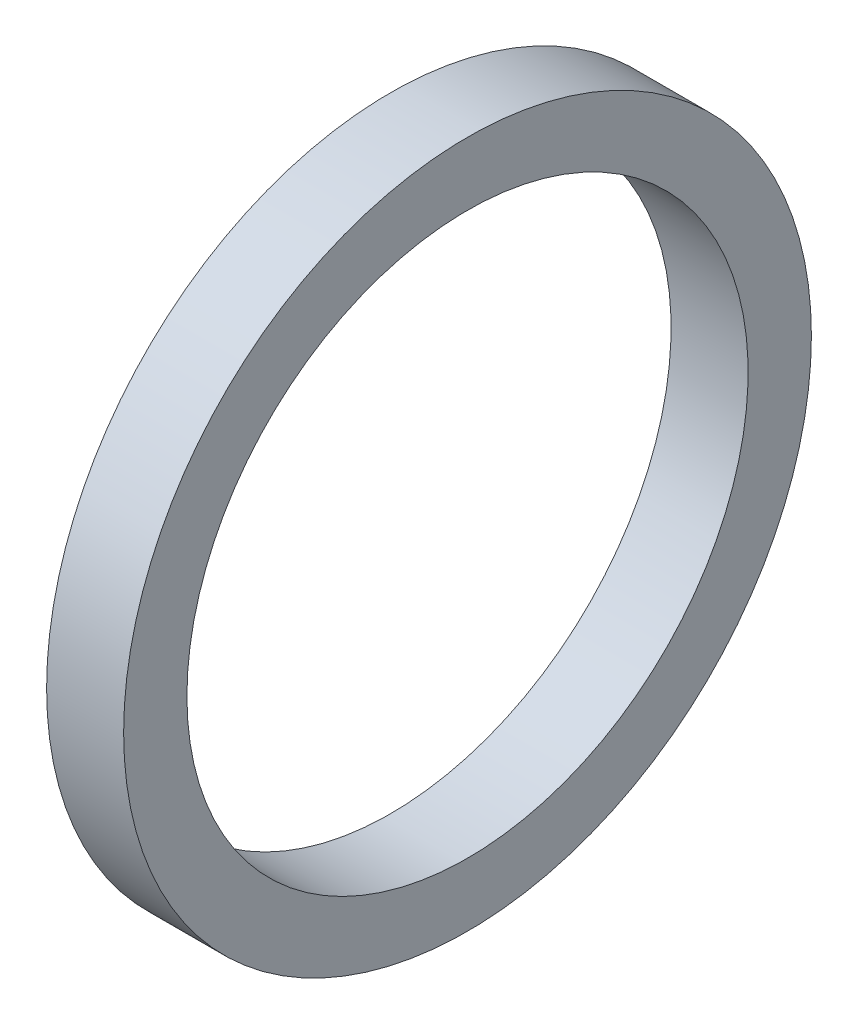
ISO-10303-21;
HEADER;
FILE_DESCRIPTION(('STEP AP214'),'2;1');
FILE_NAME('part.step','',(''),(''),'','','');
FILE_SCHEMA(('AUTOMOTIVE_DESIGN { 1 0 10303 214 1 1 1 1 }'));
ENDSEC;
DATA;
#1=APPLICATION_CONTEXT('core data for automotive mechanical design processes');
#2=APPLICATION_PROTOCOL_DEFINITION('international standard','automotive_design',2000,#1);
#3=PRODUCT_CONTEXT('',#1,'mechanical');
#4=PRODUCT('Part','Part','',(#3));
#5=PRODUCT_RELATED_PRODUCT_CATEGORY('part','',(#4));
#6=PRODUCT_DEFINITION_FORMATION('','',#4);
#7=PRODUCT_DEFINITION_CONTEXT('part definition',#1,'design');
#8=PRODUCT_DEFINITION('design','',#6,#7);
#9=PRODUCT_DEFINITION_SHAPE('','',#8);
#10=(LENGTH_UNIT() NAMED_UNIT(*) SI_UNIT(.MILLI.,.METRE.));
#11=(NAMED_UNIT(*) PLANE_ANGLE_UNIT() SI_UNIT($,.RADIAN.));
#12=(NAMED_UNIT(*) SI_UNIT($,.STERADIAN.) SOLID_ANGLE_UNIT());
#13=UNCERTAINTY_MEASURE_WITH_UNIT(LENGTH_MEASURE(1.E-05),#10,'distance_accuracy_value','');
#14=(GEOMETRIC_REPRESENTATION_CONTEXT(3) GLOBAL_UNCERTAINTY_ASSIGNED_CONTEXT((#13)) GLOBAL_UNIT_ASSIGNED_CONTEXT((#10,
#11,#12)) REPRESENTATION_CONTEXT('',''));
#15=CARTESIAN_POINT('',(0.,0.,0.));
#16=DIRECTION('',(0.,0.,1.));
#17=DIRECTION('',(1.,0.,0.));
#18=AXIS2_PLACEMENT_3D('',#15,#16,#17);
#19=CARTESIAN_POINT('',(-34.9249999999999,0.,0.));
#20=DIRECTION('',(-1.,0.,0.));
#21=DIRECTION('',(0.,0.,1.));
#22=AXIS2_PLACEMENT_3D('',#19,#20,#21);
#23=CYLINDRICAL_SURFACE('',#22,51.);
#24=CARTESIAN_POINT('',(0.,0.,0.));
#25=DIRECTION('',(-1.,0.,0.));
#26=DIRECTION('',(0.,0.,1.));
#27=AXIS2_PLACEMENT_3D('',#24,#25,#26);
#28=CIRCLE('',#27,51.);
#29=CARTESIAN_POINT('',(0.,0.,51.));
#30=VERTEX_POINT('',#29);
#31=EDGE_CURVE('E10',#30,#30,#28,.T.);
#32=ORIENTED_EDGE('',*,*,#31,.F.);
#33=EDGE_LOOP('',(#32));
#34=FACE_BOUND('',#33,.T.);
#35=CARTESIAN_POINT('',(-14.,0.,0.));
#36=DIRECTION('',(-1.,0.,0.));
#37=DIRECTION('',(0.,0.,1.));
#38=AXIS2_PLACEMENT_3D('',#35,#36,#37);
#39=CIRCLE('',#38,51.);
#40=CARTESIAN_POINT('',(-14.,0.,51.));
#41=VERTEX_POINT('',#40);
#42=EDGE_CURVE('E45',#41,#41,#39,.T.);
#43=ORIENTED_EDGE('',*,*,#42,.T.);
#44=EDGE_LOOP('',(#43));
#45=FACE_BOUND('',#44,.T.);
#46=ADVANCED_FACE('F31',(#34,#45),#23,.F.);
#47=CARTESIAN_POINT('',(0.,51.,0.));
#48=DIRECTION('',(-1.,0.,0.));
#49=DIRECTION('',(0.,0.,1.));
#50=AXIS2_PLACEMENT_3D('',#47,#48,#49);
#51=PLANE('',#50);
#52=CARTESIAN_POINT('',(0.,0.,0.));
#53=DIRECTION('',(-1.,0.,0.));
#54=DIRECTION('',(0.,0.,1.));
#55=AXIS2_PLACEMENT_3D('',#52,#53,#54);
#56=CIRCLE('',#55,62.5);
#57=CARTESIAN_POINT('',(0.,0.,62.5));
#58=VERTEX_POINT('',#57);
#59=EDGE_CURVE('E37',#58,#58,#56,.T.);
#60=ORIENTED_EDGE('',*,*,#59,.F.);
#61=EDGE_LOOP('',(#60));
#62=FACE_BOUND('',#61,.T.);
#63=ORIENTED_EDGE('',*,*,#31,.T.);
#64=EDGE_LOOP('',(#63));
#65=FACE_BOUND('',#64,.T.);
#66=ADVANCED_FACE('F60',(#62,#65),#51,.F.);
#67=CARTESIAN_POINT('',(-34.9249999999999,0.,0.));
#68=DIRECTION('',(-1.,0.,0.));
#69=DIRECTION('',(0.,0.,1.));
#70=AXIS2_PLACEMENT_3D('',#67,#68,#69);
#71=CYLINDRICAL_SURFACE('',#70,62.5);
#72=CARTESIAN_POINT('',(-14.,0.,0.));
#73=DIRECTION('',(-1.,0.,0.));
#74=DIRECTION('',(0.,0.,1.));
#75=AXIS2_PLACEMENT_3D('',#72,#73,#74);
#76=CIRCLE('',#75,62.5);
#77=CARTESIAN_POINT('',(-14.,0.,62.5));
#78=VERTEX_POINT('',#77);
#79=EDGE_CURVE('E41',#78,#78,#76,.T.);
#80=ORIENTED_EDGE('',*,*,#79,.F.);
#81=EDGE_LOOP('',(#80));
#82=FACE_BOUND('',#81,.T.);
#83=ORIENTED_EDGE('',*,*,#59,.T.);
#84=EDGE_LOOP('',(#83));
#85=FACE_BOUND('',#84,.T.);
#86=ADVANCED_FACE('F55',(#82,#85),#71,.T.);
#87=CARTESIAN_POINT('',(-14.,62.5,0.));
#88=DIRECTION('',(1.,0.,0.));
#89=DIRECTION('',(0.,0.,-1.));
#90=AXIS2_PLACEMENT_3D('',#87,#88,#89);
#91=PLANE('',#90);
#92=ORIENTED_EDGE('',*,*,#42,.F.);
#93=EDGE_LOOP('',(#92));
#94=FACE_BOUND('',#93,.T.);
#95=ORIENTED_EDGE('',*,*,#79,.T.);
#96=EDGE_LOOP('',(#95));
#97=FACE_BOUND('',#96,.T.);
#98=ADVANCED_FACE('F52',(#94,#97),#91,.F.);
#99=CLOSED_SHELL('',(#46,#66,#86,#98));
#100=MANIFOLD_SOLID_BREP('B2',#99);
#101=ADVANCED_BREP_SHAPE_REPRESENTATION('',(#18,#100),#14);
#102=SHAPE_DEFINITION_REPRESENTATION(#9,#101);
ENDSEC;
END-ISO-10303-21;
